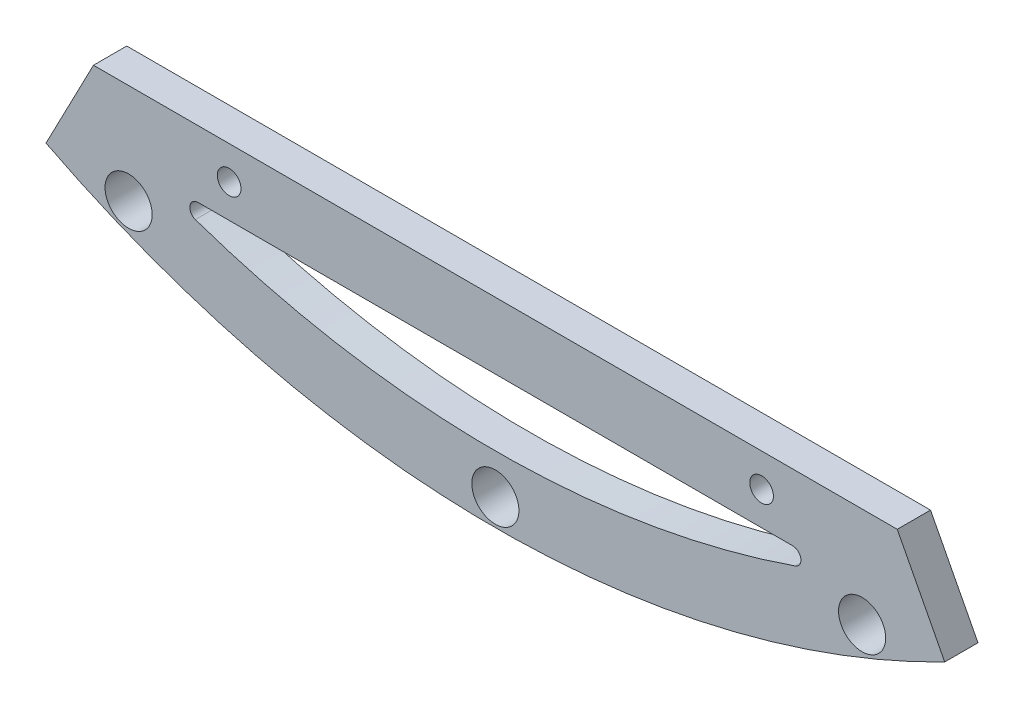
from build123d import *

# Parameters (mm, degrees)
EXTRUDE1_DEPTH                  = 3.175
F_8_CLEARANCE_HOLE1_D           = 4.4958
F_4_40_TAPPED_HOLE1_D           = 2.2606
F_4_40_TAPPED_HOLE1_ON_FACE_2_D = 2.2606


with BuildPart() as part:
    # Sketch1 → Extrude1 (new body)
    with BuildSketch(Plane.XY):
        with BuildLine():
            Line((-42.874128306, -83.630434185), (-38.344968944, -74.93))
            Line((-38.344968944, -74.93), (38.344968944, -74.93))
            Line((38.344968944, -74.93), (42.874128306, -83.630434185))
            ThreePointArc((42.874128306, -83.630434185), (0, -93.98), (-42.874128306, -83.630434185))
        make_face()
        with BuildLine():
            Line((28.362543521, -81.28), (-28.362543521, -81.28))
            ThreePointArc((-28.362543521, -81.28), (-29.145334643, -81.942307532), (-28.621798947, -82.823967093))
            ThreePointArc((-28.621798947, -82.823967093), (0, -87.63), (28.621798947, -82.823967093))
            ThreePointArc((28.621798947, -82.823967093), (29.145334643, -81.942307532), (28.362543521, -81.28))
        make_face(mode=Mode.SUBTRACT)
    extrude(amount=EXTRUDE1_DEPTH)

    # 8 Clearance Hole1 (through all)
    with Locations(Plane(origin=(0, 0, 0), x_dir=(-1, 0, 0), z_dir=(0, 0, -1))):
        with Locations((-34.992573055, -84.479544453), (34.992573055, -84.479544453), (0, -91.44)):
            Hole(F_8_CLEARANCE_HOLE1_D / 2)

    # 4-40 Tapped Hole1 (through all)
    with Locations(Plane(origin=(-25.4, -78.105, 3.175), x_dir=(1, 0, 0), z_dir=(0, 0, 1))):
        with Locations((0, 0), (50.8, 0)):
            Hole(F_4_40_TAPPED_HOLE1_D / 2)

    # 4-40 Tapped Hole1 on face 2 (through all)
    with Locations(Plane(origin=(-11.203589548, -68.187084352, 0), x_dir=(1, 0, 0), z_dir=(0, 0, 1))):
        with Locations((0, 0)):
            Hole(F_4_40_TAPPED_HOLE1_ON_FACE_2_D / 2)


solid = part.part
